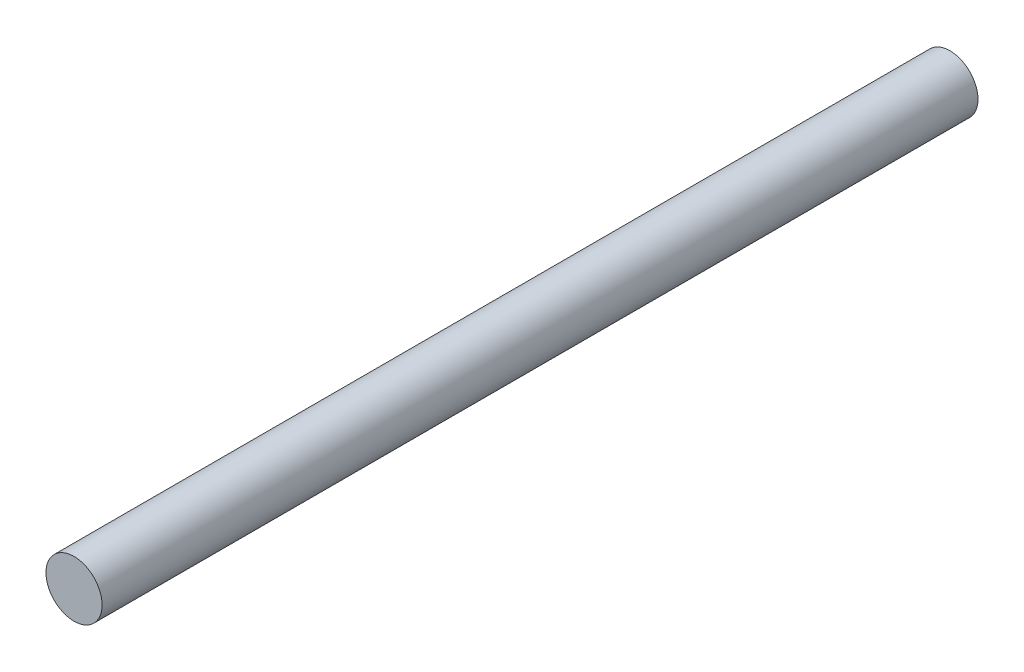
from build123d import *

# Parameters (mm, degrees)
SKETCH1_R           = 3.175
BOSS_EXTRUDE1_DEPTH = 99.06


with BuildPart() as part:
    # Sketch1 → Boss-Extrude1 (new body)
    with BuildSketch(Plane.XY):
        Circle(SKETCH1_R)
    extrude(amount=BOSS_EXTRUDE1_DEPTH)


solid = part.part
